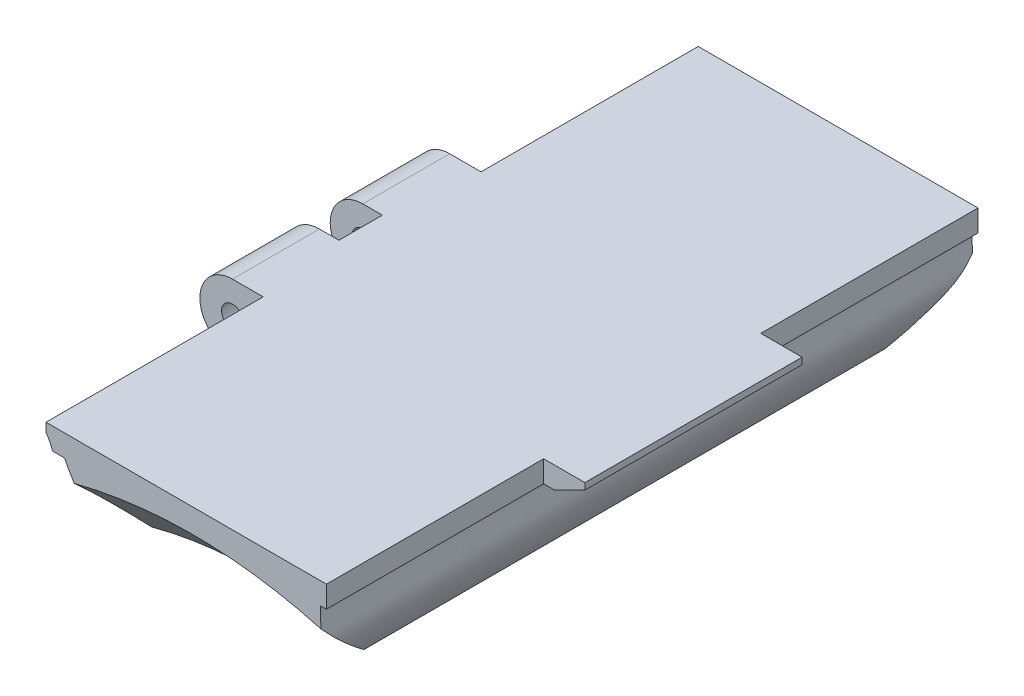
ISO-10303-21;
HEADER;
FILE_DESCRIPTION(('STEP AP214'),'2;1');
FILE_NAME('part.step','',(''),(''),'','','');
FILE_SCHEMA(('AUTOMOTIVE_DESIGN { 1 0 10303 214 1 1 1 1 }'));
ENDSEC;
DATA;
#1=APPLICATION_CONTEXT('core data for automotive mechanical design processes');
#2=APPLICATION_PROTOCOL_DEFINITION('international standard','automotive_design',2000,#1);
#3=PRODUCT_CONTEXT('',#1,'mechanical');
#4=PRODUCT('Part','Part','',(#3));
#5=PRODUCT_RELATED_PRODUCT_CATEGORY('part','',(#4));
#6=PRODUCT_DEFINITION_FORMATION('','',#4);
#7=PRODUCT_DEFINITION_CONTEXT('part definition',#1,'design');
#8=PRODUCT_DEFINITION('design','',#6,#7);
#9=PRODUCT_DEFINITION_SHAPE('','',#8);
#10=(LENGTH_UNIT() NAMED_UNIT(*) SI_UNIT(.MILLI.,.METRE.));
#11=(NAMED_UNIT(*) PLANE_ANGLE_UNIT() SI_UNIT($,.RADIAN.));
#12=(NAMED_UNIT(*) SI_UNIT($,.STERADIAN.) SOLID_ANGLE_UNIT());
#13=UNCERTAINTY_MEASURE_WITH_UNIT(LENGTH_MEASURE(1.E-05),#10,'distance_accuracy_value','');
#14=(GEOMETRIC_REPRESENTATION_CONTEXT(3) GLOBAL_UNCERTAINTY_ASSIGNED_CONTEXT((#13)) GLOBAL_UNIT_ASSIGNED_CONTEXT((#10,
#11,#12)) REPRESENTATION_CONTEXT('',''));
#15=CARTESIAN_POINT('',(0.,0.,0.));
#16=DIRECTION('',(0.,0.,1.));
#17=DIRECTION('',(1.,0.,0.));
#18=AXIS2_PLACEMENT_3D('',#15,#16,#17);
#19=CARTESIAN_POINT('',(-40.8141571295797,107.5,-95.));
#20=DIRECTION('',(0.,0.,-1.));
#21=DIRECTION('',(-1.,0.,0.));
#22=AXIS2_PLACEMENT_3D('',#19,#20,#21);
#23=CYLINDRICAL_SURFACE('',#22,7.50000000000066);
#24=DIRECTION('',(0.,0.,1.));
#25=VECTOR('',#24,1.);
#26=CARTESIAN_POINT('',(-40.8141571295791,115.,-45.));
#27=LINE('',#26,#25);
#28=CARTESIAN_POINT('',(-40.8141571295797,115.,-115.));
#29=VERTEX_POINT('',#28);
#30=CARTESIAN_POINT('',(-40.8141571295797,115.,-95.));
#31=VERTEX_POINT('',#30);
#32=EDGE_CURVE('E280',#29,#31,#27,.T.);
#33=ORIENTED_EDGE('',*,*,#32,.F.);
#34=CARTESIAN_POINT('',(-40.8141571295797,107.5,-115.));
#35=DIRECTION('',(0.,0.,-1.));
#36=DIRECTION('',(-1.,0.,0.));
#37=AXIS2_PLACEMENT_3D('',#34,#35,#36);
#38=CIRCLE('',#37,7.50000000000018);
#39=CARTESIAN_POINT('',(-36.3141571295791,101.5,-115.));
#40=VERTEX_POINT('',#39);
#41=EDGE_CURVE('E265',#40,#29,#38,.T.);
#42=ORIENTED_EDGE('',*,*,#41,.F.);
#43=DIRECTION('',(0.,0.,-1.));
#44=VECTOR('',#43,1.);
#45=CARTESIAN_POINT('',(-36.3141571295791,101.5,-115.));
#46=LINE('',#45,#44);
#47=CARTESIAN_POINT('',(-36.3141571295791,101.5,-125.));
#48=VERTEX_POINT('',#47);
#49=EDGE_CURVE('E577',#40,#48,#46,.T.);
#50=ORIENTED_EDGE('',*,*,#49,.T.);
#51=CARTESIAN_POINT('',(-40.8141571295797,107.5,-125.));
#52=DIRECTION('',(0.,0.,-1.));
#53=DIRECTION('',(-1.,0.,0.));
#54=AXIS2_PLACEMENT_3D('',#51,#52,#53);
#55=CIRCLE('',#54,7.50000000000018);
#56=CARTESIAN_POINT('',(-40.8141571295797,115.,-125.));
#57=VERTEX_POINT('',#56);
#58=EDGE_CURVE('E602',#48,#57,#55,.T.);
#59=ORIENTED_EDGE('',*,*,#58,.T.);
#60=CARTESIAN_POINT('',(-40.8141571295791,115.,-145.));
#61=VERTEX_POINT('',#60);
#62=EDGE_CURVE('E290',#61,#57,#27,.T.);
#63=ORIENTED_EDGE('',*,*,#62,.F.);
#64=CARTESIAN_POINT('',(-40.8141571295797,107.5,-145.));
#65=DIRECTION('',(0.,0.,-1.));
#66=DIRECTION('',(-1.,0.,0.));
#67=AXIS2_PLACEMENT_3D('',#64,#65,#66);
#68=CIRCLE('',#67,7.50000000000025);
#69=CARTESIAN_POINT('',(-33.7430893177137,110.,-145.));
#70=VERTEX_POINT('',#69);
#71=EDGE_CURVE('E101',#70,#61,#68,.T.);
#72=ORIENTED_EDGE('',*,*,#71,.F.);
#73=DIRECTION('',(0.,0.,-1.));
#74=VECTOR('',#73,1.);
#75=CARTESIAN_POINT('',(-33.7430893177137,110.,-45.));
#76=LINE('',#75,#74);
#77=CARTESIAN_POINT('',(-33.7430893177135,110.,-95.));
#78=VERTEX_POINT('',#77);
#79=EDGE_CURVE('E507',#78,#70,#76,.T.);
#80=ORIENTED_EDGE('',*,*,#79,.F.);
#81=CARTESIAN_POINT('',(-40.8141571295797,107.5,-95.));
#82=DIRECTION('',(0.,0.,1.));
#83=DIRECTION('',(1.,0.,0.));
#84=AXIS2_PLACEMENT_3D('',#81,#82,#83);
#85=CIRCLE('',#84,7.50000000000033);
#86=EDGE_CURVE('E288',#31,#78,#85,.T.);
#87=ORIENTED_EDGE('',*,*,#86,.F.);
#88=EDGE_LOOP('',(#33,#42,#50,#59,#63,#72,#80,#87));
#89=FACE_BOUND('',#88,.T.);
#90=ADVANCED_FACE('F67',(#89),#23,.T.);
#91=CARTESIAN_POINT('',(1.49519052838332,115.,-45.));
#92=DIRECTION('',(0.,1.,0.));
#93=DIRECTION('',(1.,0.,0.));
#94=AXIS2_PLACEMENT_3D('',#91,#92,#93);
#95=PLANE('',#94);
#96=DIRECTION('',(0.,0.,-1.));
#97=VECTOR('',#96,1.);
#98=CARTESIAN_POINT('',(-36.3141571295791,115.,-115.));
#99=LINE('',#98,#97);
#100=CARTESIAN_POINT('',(-36.3141571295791,115.,-115.));
#101=VERTEX_POINT('',#100);
#102=CARTESIAN_POINT('',(-36.3141571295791,115.,-125.));
#103=VERTEX_POINT('',#102);
#104=EDGE_CURVE('E283',#101,#103,#99,.T.);
#105=ORIENTED_EDGE('',*,*,#104,.F.);
#106=DIRECTION('',(1.,0.,0.));
#107=VECTOR('',#106,1.);
#108=CARTESIAN_POINT('',(-40.8141571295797,115.,-115.));
#109=LINE('',#108,#107);
#110=EDGE_CURVE('E268',#29,#101,#109,.T.);
#111=ORIENTED_EDGE('',*,*,#110,.F.);
#112=ORIENTED_EDGE('',*,*,#32,.T.);
#113=DIRECTION('',(-1.,1.99394871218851E-13,0.));
#114=VECTOR('',#113,1.);
#115=CARTESIAN_POINT('',(-35.9702740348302,115.,-95.));
#116=LINE('',#115,#114);
#117=CARTESIAN_POINT('',(-33.7430893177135,115.,-95.));
#118=VERTEX_POINT('',#117);
#119=EDGE_CURVE('E538',#118,#31,#116,.T.);
#120=ORIENTED_EDGE('',*,*,#119,.F.);
#121=DIRECTION('',(0.,0.,1.));
#122=VECTOR('',#121,1.);
#123=CARTESIAN_POINT('',(-33.7430893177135,115.,-95.));
#124=LINE('',#123,#122);
#125=CARTESIAN_POINT('',(-33.7430893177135,115.,-45.));
#126=VERTEX_POINT('',#125);
#127=EDGE_CURVE('E314',#118,#126,#124,.T.);
#128=ORIENTED_EDGE('',*,*,#127,.T.);
#129=DIRECTION('',(1.,0.,0.));
#130=VECTOR('',#129,1.);
#131=CARTESIAN_POINT('',(1.49519052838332,115.,-45.));
#132=LINE('',#131,#130);
#133=CARTESIAN_POINT('',(30.8141571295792,115.,-45.));
#134=VERTEX_POINT('',#133);
#135=EDGE_CURVE('E297',#126,#134,#132,.T.);
#136=ORIENTED_EDGE('',*,*,#135,.T.);
#137=DIRECTION('',(0.,0.,-1.));
#138=VECTOR('',#137,1.);
#139=CARTESIAN_POINT('',(30.8141571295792,115.,-45.));
#140=LINE('',#139,#138);
#141=CARTESIAN_POINT('',(30.8141571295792,115.,-95.));
#142=VERTEX_POINT('',#141);
#143=EDGE_CURVE('E801',#134,#142,#140,.T.);
#144=ORIENTED_EDGE('',*,*,#143,.T.);
#145=DIRECTION('',(1.,0.,0.));
#146=VECTOR('',#145,1.);
#147=CARTESIAN_POINT('',(37.0641571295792,115.,-95.));
#148=LINE('',#147,#146);
#149=CARTESIAN_POINT('',(40.3141571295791,115.,-95.));
#150=VERTEX_POINT('',#149);
#151=EDGE_CURVE('E308',#142,#150,#148,.T.);
#152=ORIENTED_EDGE('',*,*,#151,.T.);
#153=DIRECTION('',(0.,0.,-1.));
#154=VECTOR('',#153,1.);
#155=CARTESIAN_POINT('',(40.3141571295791,115.,-120.));
#156=LINE('',#155,#154);
#157=CARTESIAN_POINT('',(40.3141571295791,115.,-145.));
#158=VERTEX_POINT('',#157);
#159=EDGE_CURVE('E313',#150,#158,#156,.T.);
#160=ORIENTED_EDGE('',*,*,#159,.T.);
#161=DIRECTION('',(1.,0.,0.));
#162=VECTOR('',#161,1.);
#163=CARTESIAN_POINT('',(37.0641571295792,115.,-145.));
#164=LINE('',#163,#162);
#165=CARTESIAN_POINT('',(30.8141571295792,115.,-145.));
#166=VERTEX_POINT('',#165);
#167=EDGE_CURVE('E315',#166,#158,#164,.T.);
#168=ORIENTED_EDGE('',*,*,#167,.F.);
#169=DIRECTION('',(0.,0.,-1.));
#170=VECTOR('',#169,1.);
#171=CARTESIAN_POINT('',(30.8141571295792,115.,-45.));
#172=LINE('',#171,#170);
#173=CARTESIAN_POINT('',(30.8141571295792,115.,-195.));
#174=VERTEX_POINT('',#173);
#175=EDGE_CURVE('E298',#166,#174,#172,.T.);
#176=ORIENTED_EDGE('',*,*,#175,.T.);
#177=DIRECTION('',(1.,0.,0.));
#178=VECTOR('',#177,1.);
#179=CARTESIAN_POINT('',(1.49519052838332,115.,-195.));
#180=LINE('',#179,#178);
#181=CARTESIAN_POINT('',(-33.5924875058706,115.,-195.));
#182=VERTEX_POINT('',#181);
#183=EDGE_CURVE('E291',#182,#174,#180,.T.);
#184=ORIENTED_EDGE('',*,*,#183,.F.);
#185=DIRECTION('',(0.,0.,-1.));
#186=VECTOR('',#185,1.);
#187=CARTESIAN_POINT('',(-33.5924875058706,115.,-145.));
#188=LINE('',#187,#186);
#189=CARTESIAN_POINT('',(-33.5924875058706,115.,-145.));
#190=VERTEX_POINT('',#189);
#191=EDGE_CURVE('E564',#190,#182,#188,.T.);
#192=ORIENTED_EDGE('',*,*,#191,.F.);
#193=DIRECTION('',(1.,0.,0.));
#194=VECTOR('',#193,1.);
#195=CARTESIAN_POINT('',(-33.5924875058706,115.,-145.));
#196=LINE('',#195,#194);
#197=EDGE_CURVE('E572',#61,#190,#196,.T.);
#198=ORIENTED_EDGE('',*,*,#197,.F.);
#199=ORIENTED_EDGE('',*,*,#62,.T.);
#200=DIRECTION('',(1.,0.,0.));
#201=VECTOR('',#200,1.);
#202=CARTESIAN_POINT('',(-40.8141571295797,115.,-125.));
#203=LINE('',#202,#201);
#204=EDGE_CURVE('E599',#57,#103,#203,.T.);
#205=ORIENTED_EDGE('',*,*,#204,.T.);
#206=EDGE_LOOP('',(#105,#111,#112,#120,#128,#136,#144,#152,#160,#168,#176,#184,#192,#198,#199,#205));
#207=FACE_BOUND('',#206,.T.);
#208=ADVANCED_FACE('F278',(#207),#95,.T.);
#209=CARTESIAN_POINT('',(40.3141571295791,90.,-120.));
#210=DIRECTION('',(1.,0.,0.));
#211=DIRECTION('',(0.,1.,0.));
#212=AXIS2_PLACEMENT_3D('',#209,#210,#211);
#213=PLANE('',#212);
#214=DIRECTION('',(0.,1.,0.));
#215=VECTOR('',#214,1.);
#216=CARTESIAN_POINT('',(40.3141571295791,90.,-145.));
#217=LINE('',#216,#215);
#218=CARTESIAN_POINT('',(40.3141571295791,113.5,-145.));
#219=VERTEX_POINT('',#218);
#220=EDGE_CURVE('E448',#219,#158,#217,.T.);
#221=ORIENTED_EDGE('',*,*,#220,.T.);
#222=ORIENTED_EDGE('',*,*,#159,.F.);
#223=DIRECTION('',(0.,1.,0.));
#224=VECTOR('',#223,1.);
#225=CARTESIAN_POINT('',(40.3141571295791,90.,-95.));
#226=LINE('',#225,#224);
#227=CARTESIAN_POINT('',(40.3141571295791,113.5,-95.));
#228=VERTEX_POINT('',#227);
#229=EDGE_CURVE('E443',#228,#150,#226,.T.);
#230=ORIENTED_EDGE('',*,*,#229,.F.);
#231=DIRECTION('',(0.,0.,1.));
#232=VECTOR('',#231,1.);
#233=CARTESIAN_POINT('',(40.3141571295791,113.5,-95.));
#234=LINE('',#233,#232);
#235=EDGE_CURVE('E747',#219,#228,#234,.T.);
#236=ORIENTED_EDGE('',*,*,#235,.F.);
#237=EDGE_LOOP('',(#221,#222,#230,#236));
#238=FACE_BOUND('',#237,.T.);
#239=ADVANCED_FACE('F370',(#238),#213,.T.);
#240=CARTESIAN_POINT('',(0.,0.,-195.));
#241=DIRECTION('',(0.,0.,-1.));
#242=DIRECTION('',(-1.,0.,0.));
#243=AXIS2_PLACEMENT_3D('',#240,#241,#242);
#244=CONICAL_SURFACE('',#243,109.5,0.785398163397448);
#245=CARTESIAN_POINT('',(24.4583997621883,91.2799905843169,-180.));
#246=CARTESIAN_POINT('',(24.5987242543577,91.4954660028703,-180.24445255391));
#247=CARTESIAN_POINT('',(24.7373274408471,91.7116619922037,-180.489255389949));
#248=CARTESIAN_POINT('',(25.0112410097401,92.1454601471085,-180.979538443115));
#249=CARTESIAN_POINT('',(25.1465508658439,92.3630625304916,-181.22501876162));
#250=CARTESIAN_POINT('',(25.4139973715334,92.7995933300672,-181.71658215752));
#251=CARTESIAN_POINT('',(25.5461336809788,93.0185218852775,-181.962665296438));
#252=CARTESIAN_POINT('',(25.8072430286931,93.4576720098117,-182.455379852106));
#253=CARTESIAN_POINT('',(25.9362159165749,93.6778936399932,-182.702011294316));
#254=CARTESIAN_POINT('',(26.1924451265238,94.1222206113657,-183.198681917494));
#255=CARTESIAN_POINT('',(26.3196634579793,94.3463411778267,-183.448727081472));
#256=CARTESIAN_POINT('',(26.5706891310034,94.7959259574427,-183.949304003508));
#257=CARTESIAN_POINT('',(26.6944965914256,95.0213901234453,-184.199835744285));
#258=CARTESIAN_POINT('',(26.9385076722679,95.4737155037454,-184.701362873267));
#259=CARTESIAN_POINT('',(27.058711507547,95.7005766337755,-184.952358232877));
#260=CARTESIAN_POINT('',(27.2952412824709,96.1557831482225,-185.45480054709));
#261=CARTESIAN_POINT('',(27.4115674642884,96.3841284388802,-185.706247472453));
#262=CARTESIAN_POINT('',(27.6097890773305,96.781865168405,-186.143075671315));
#263=CARTESIAN_POINT('',(27.6926582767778,96.9508863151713,-186.328352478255));
#264=CARTESIAN_POINT('',(27.8559110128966,97.2898629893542,-186.699151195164));
#265=CARTESIAN_POINT('',(27.9362945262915,97.4598185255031,-186.884673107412));
#266=CARTESIAN_POINT('',(28.0943485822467,97.800742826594,-187.255967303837));
#267=CARTESIAN_POINT('',(28.1720189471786,97.9717116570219,-187.441739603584));
#268=CARTESIAN_POINT('',(28.3243630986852,98.3147628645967,-187.813544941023));
#269=CARTESIAN_POINT('',(28.3990364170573,98.4868454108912,-187.999578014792));
#270=CARTESIAN_POINT('',(28.5445713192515,98.8311451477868,-188.370731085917));
#271=CARTESIAN_POINT('',(28.6154533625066,99.0033551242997,-188.555849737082));
#272=CARTESIAN_POINT('',(28.7533945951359,99.349082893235,-188.926290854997));
#273=CARTESIAN_POINT('',(28.8204538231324,99.5226006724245,-189.111613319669));
#274=CARTESIAN_POINT('',(28.9500555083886,99.871110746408,-189.482422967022));
#275=CARTESIAN_POINT('',(29.0125983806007,100.046102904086,-189.667910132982));
#276=CARTESIAN_POINT('',(29.1322261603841,100.397814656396,-190.039024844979));
#277=CARTESIAN_POINT('',(29.1893110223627,100.574534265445,-190.224652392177));
#278=CARTESIAN_POINT('',(29.2800999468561,100.875356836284,-190.538858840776));
#279=CARTESIAN_POINT('',(29.3155955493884,100.998927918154,-190.667426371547));
#280=CARTESIAN_POINT('',(29.3826207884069,101.247177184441,-190.92451941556));
#281=CARTESIAN_POINT('',(29.4141504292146,101.371855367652,-191.053044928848));
#282=CARTESIAN_POINT('',(29.5020380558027,101.747602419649,-191.438400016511));
#283=CARTESIAN_POINT('',(29.5517195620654,102.00046359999,-191.695091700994));
#284=CARTESIAN_POINT('',(29.6098671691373,102.383333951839,-192.079036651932));
#285=CARTESIAN_POINT('',(29.6265216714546,102.511570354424,-192.206852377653));
#286=CARTESIAN_POINT('',(29.6539632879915,102.769179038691,-192.461961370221));
#287=CARTESIAN_POINT('',(29.664750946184,102.898551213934,-192.589254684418));
#288=CARTESIAN_POINT('',(29.6776854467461,103.116103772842,-192.801889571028));
#289=CARTESIAN_POINT('',(29.6815011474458,103.204005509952,-192.887419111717));
#290=CARTESIAN_POINT('',(29.6864994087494,103.380208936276,-193.058148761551));
#291=CARTESIAN_POINT('',(29.6876818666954,103.468510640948,-193.143348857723));
#292=CARTESIAN_POINT('',(29.6876685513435,103.645430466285,-193.313414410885));
#293=CARTESIAN_POINT('',(29.686472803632,103.734048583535,-193.398279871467));
#294=CARTESIAN_POINT('',(29.6820430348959,103.911653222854,-193.567824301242));
#295=CARTESIAN_POINT('',(29.6788060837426,104.000640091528,-193.652502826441));
#296=CARTESIAN_POINT('',(29.6706935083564,104.178785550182,-193.821598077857));
#297=CARTESIAN_POINT('',(29.6658178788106,104.267944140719,-193.906014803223));
#298=CARTESIAN_POINT('',(29.654853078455,104.446379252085,-194.074654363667));
#299=CARTESIAN_POINT('',(29.6487638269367,104.535655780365,-194.158877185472));
#300=CARTESIAN_POINT('',(29.6357867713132,104.714323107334,-194.32724100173));
#301=CARTESIAN_POINT('',(29.6288985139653,104.803713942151,-194.411381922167));
#302=CARTESIAN_POINT('',(29.6147019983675,104.982513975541,-194.579594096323));
#303=CARTESIAN_POINT('',(29.6073937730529,105.071923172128,-194.663665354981));
#304=CARTESIAN_POINT('',(29.5926453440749,105.250720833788,-194.831779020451));
#305=CARTESIAN_POINT('',(29.5852051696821,105.34010929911,-194.91582142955));
#306=CARTESIAN_POINT('',(29.577841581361,105.429483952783,-194.99988492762));
#307=B_SPLINE_CURVE_WITH_KNOTS('',3,(#245,#246,#247,#248,#249,#250,#251,#252,#253,#254,#255,
#256,#257,#258,#259,#260,#261,#262,#263,#264,#265,#266,#267,#268,#269,#270,#271,#272,#273,#274,
#275,#276,#277,#278,#279,#280,#281,#282,#283,#284,#285,#286,#287,#288,#289,#290,#291,#292,#293,
#294,#295,#296,#297,#298,#299,#300,#301,#302,#303,#304,#305,#306),.UNSPECIFIED.,.F.,.F.,(4,2,2,
2,2,2,2,2,2,2,2,2,2,2,2,2,2,2,2,2,2,2,2,2,2,2,2,2,2,2,4),(0.,1.06436950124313,2.12890799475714,
3.19356008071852,4.25826268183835,5.33547882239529,6.41265737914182,7.48977158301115,
8.56681839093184,9.35918687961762,10.1515627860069,10.9439904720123,11.7365414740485,
12.524261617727,13.3119738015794,14.0996135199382,14.8872598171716,15.4326830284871,
15.9781056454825,17.0685966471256,17.6139807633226,18.1593143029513,18.5274011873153,
18.895502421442,19.2635996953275,19.6322265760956,20.0008546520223,20.3695072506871,
20.7383700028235,21.1072038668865,21.4759569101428),.UNSPECIFIED.);
#308=CARTESIAN_POINT('',(24.4583997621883,91.2799905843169,-180.));
#309=VERTEX_POINT('',#308);
#310=CARTESIAN_POINT('',(29.578468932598,105.429427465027,-195.));
#311=VERTEX_POINT('',#310);
#312=EDGE_CURVE('E354',#309,#311,#307,.T.);
#313=ORIENTED_EDGE('',*,*,#312,.F.);
#314=CARTESIAN_POINT('',(0.,0.,-180.));
#315=DIRECTION('',(0.,0.,-1.));
#316=DIRECTION('',(1.,0.,0.));
#317=AXIS2_PLACEMENT_3D('',#314,#315,#316);
#318=CIRCLE('',#317,94.5);
#319=CARTESIAN_POINT('',(-24.4583997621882,91.279990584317,-180.));
#320=VERTEX_POINT('',#319);
#321=EDGE_CURVE('E480',#320,#309,#318,.T.);
#322=ORIENTED_EDGE('',*,*,#321,.F.);
#323=CARTESIAN_POINT('',(-27.2318477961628,106.059681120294,-194.999906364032));
#324=CARTESIAN_POINT('',(-27.1799094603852,105.97888651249,-194.908733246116));
#325=CARTESIAN_POINT('',(-27.1278930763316,105.898119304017,-194.817580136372));
#326=CARTESIAN_POINT('',(-27.0240097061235,105.736501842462,-194.635255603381));
#327=CARTESIAN_POINT('',(-26.9721427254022,105.655651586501,-194.544084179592));
#328=CARTESIAN_POINT('',(-26.86902321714,105.493980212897,-194.361946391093));
#329=CARTESIAN_POINT('',(-26.8177693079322,105.41315974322,-194.270980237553));
#330=CARTESIAN_POINT('',(-26.7161233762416,105.25113415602,-194.088911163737));
#331=CARTESIAN_POINT('',(-26.6657313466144,105.169929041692,-193.997808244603));
#332=CARTESIAN_POINT('',(-26.5168667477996,104.926029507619,-193.724825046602));
#333=CARTESIAN_POINT('',(-26.4203364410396,104.762484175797,-193.542629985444));
#334=CARTESIAN_POINT('',(-26.236190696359,104.432401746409,-193.177582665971));
#335=CARTESIAN_POINT('',(-26.1485479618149,104.265875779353,-192.994734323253));
#336=CARTESIAN_POINT('',(-26.0252625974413,104.013252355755,-192.719730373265));
#337=CARTESIAN_POINT('',(-25.9855604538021,103.928644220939,-192.628017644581));
#338=CARTESIAN_POINT('',(-25.9088475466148,103.758487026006,-192.444339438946));
#339=CARTESIAN_POINT('',(-25.8718368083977,103.672937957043,-192.352373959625));
#340=CARTESIAN_POINT('',(-25.7647180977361,103.415014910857,-192.076194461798));
#341=CARTESIAN_POINT('',(-25.6985116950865,103.241340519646,-191.891670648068));
#342=CARTESIAN_POINT('',(-25.5760070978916,102.892653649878,-191.523723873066));
#343=CARTESIAN_POINT('',(-25.5196308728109,102.717664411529,-191.340304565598));
#344=CARTESIAN_POINT('',(-25.4149177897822,102.365363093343,-190.97315079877));
#345=CARTESIAN_POINT('',(-25.3665868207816,102.188049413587,-190.789416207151));
#346=CARTESIAN_POINT('',(-25.276622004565,101.831558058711,-190.421751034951));
#347=CARTESIAN_POINT('',(-25.2349952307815,101.65237862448,-190.237820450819));
#348=CARTESIAN_POINT('',(-25.1569928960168,101.292628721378,-189.869875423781));
#349=CARTESIAN_POINT('',(-25.1206222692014,101.112057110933,-189.685861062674));
#350=CARTESIAN_POINT('',(-25.0522481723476,100.749862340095,-189.317868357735));
#351=CARTESIAN_POINT('',(-25.0202470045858,100.568238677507,-189.133890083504));
#352=CARTESIAN_POINT('',(-24.9599594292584,100.20422777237,-188.766096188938));
#353=CARTESIAN_POINT('',(-24.9316729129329,100.021840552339,-188.582280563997));
#354=CARTESIAN_POINT('',(-24.8642257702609,99.5599828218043,-188.117830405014));
#355=CARTESIAN_POINT('',(-24.8272069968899,99.280086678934,-187.837307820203));
#356=CARTESIAN_POINT('',(-24.7595193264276,98.7193218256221,-187.276898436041));
#357=CARTESIAN_POINT('',(-24.7288457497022,98.4384539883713,-186.997011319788));
#358=CARTESIAN_POINT('',(-24.6730112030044,97.8758659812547,-186.437807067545));
#359=CARTESIAN_POINT('',(-24.6478477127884,97.5941462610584,-186.158489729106));
#360=CARTESIAN_POINT('',(-24.6024199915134,97.0299411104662,-185.600381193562));
#361=CARTESIAN_POINT('',(-24.5821544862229,96.7474558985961,-185.321589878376));
#362=CARTESIAN_POINT('',(-24.5460705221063,96.1817785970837,-184.764502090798));
#363=CARTESIAN_POINT('',(-24.5302515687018,95.8985865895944,-184.486205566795));
#364=CARTESIAN_POINT('',(-24.5025550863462,95.3277183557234,-183.926346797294));
#365=CARTESIAN_POINT('',(-24.4907334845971,95.0400330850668,-183.644791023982));
#366=CARTESIAN_POINT('',(-24.4711138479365,94.4639939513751,-183.082158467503));
#367=CARTESIAN_POINT('',(-24.4633162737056,94.1756400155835,-182.80108174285));
#368=CARTESIAN_POINT('',(-24.451640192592,93.5982790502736,-182.23942342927));
#369=CARTESIAN_POINT('',(-24.4477623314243,93.309271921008,-181.958841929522));
#370=CARTESIAN_POINT('',(-24.4439169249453,92.7306060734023,-181.398202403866));
#371=CARTESIAN_POINT('',(-24.4439502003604,92.4409472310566,-181.118144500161));
#372=CARTESIAN_POINT('',(-24.4480842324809,91.8609564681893,-180.558604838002));
#373=CARTESIAN_POINT('',(-24.4521860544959,91.5706243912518,-180.279123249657));
#374=CARTESIAN_POINT('',(-24.4583997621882,91.279990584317,-180.));
#375=B_SPLINE_CURVE_WITH_KNOTS('',3,(#323,#324,#325,#326,#327,#328,#329,#330,#331,#332,#333,
#334,#335,#336,#337,#338,#339,#340,#341,#342,#343,#344,#345,#346,#347,#348,#349,#350,#351,#352,
#353,#354,#355,#356,#357,#358,#359,#360,#361,#362,#363,#364,#365,#366,#367,#368,#369,#370,#371,
#372,#373,#374),.UNSPECIFIED.,.F.,.F.,(4,2,2,2,2,2,2,2,2,2,2,2,2,2,2,2,2,2,2,2,2,2,2,2,2,4),(0.,
0.397292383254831,0.794599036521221,1.1907070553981,1.58681178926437,2.3762274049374,
3.16313995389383,3.55593844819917,3.9487406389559,4.73423044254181,5.51316916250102,
6.29267556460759,7.07299909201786,7.85405044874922,8.63551176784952,9.41695020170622,
10.610887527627,11.8039411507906,12.9964479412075,14.1886441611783,15.3807077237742,
16.5888191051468,17.7970687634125,19.0055174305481,20.2142196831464,21.4232385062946),.UNSPECIFIED.);
#376=CARTESIAN_POINT('',(-27.2313239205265,106.059912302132,-195.));
#377=VERTEX_POINT('',#376);
#378=EDGE_CURVE('E479',#377,#320,#375,.T.);
#379=ORIENTED_EDGE('',*,*,#378,.F.);
#380=CARTESIAN_POINT('',(0.,0.,-195.));
#381=DIRECTION('',(0.,0.,1.));
#382=DIRECTION('',(1.,0.,0.));
#383=AXIS2_PLACEMENT_3D('',#380,#381,#382);
#384=CIRCLE('',#383,109.5);
#385=EDGE_CURVE('E12',#311,#377,#384,.T.);
#386=ORIENTED_EDGE('',*,*,#385,.F.);
#387=EDGE_LOOP('',(#313,#322,#379,#386));
#388=FACE_BOUND('',#387,.T.);
#389=ADVANCED_FACE('F359',(#388),#244,.F.);
#390=CARTESIAN_POINT('',(0.,0.,-60.));
#391=DIRECTION('',(0.,0.,1.));
#392=DIRECTION('',(1.,0.,0.));
#393=AXIS2_PLACEMENT_3D('',#390,#391,#392);
#394=CONICAL_SURFACE('',#393,94.5,0.785398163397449);
#395=CARTESIAN_POINT('',(29.577841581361,105.429483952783,-45.0001150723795));
#396=CARTESIAN_POINT('',(29.5852003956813,105.340167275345,-45.0841240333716));
#397=CARTESIAN_POINT('',(29.5926356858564,105.250836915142,-45.1681118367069));
#398=CARTESIAN_POINT('',(29.6073733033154,105.072172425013,-45.3361002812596));
#399=CARTESIAN_POINT('',(29.6146756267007,104.982838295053,-45.4201009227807));
#400=CARTESIAN_POINT('',(29.6288396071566,104.8044636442,-45.5879126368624));
#401=CARTESIAN_POINT('',(29.6357025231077,104.715423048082,-45.6717235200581));
#402=CARTESIAN_POINT('',(29.6486409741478,104.537406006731,-45.8394725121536));
#403=CARTESIAN_POINT('',(29.6547165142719,104.448429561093,-45.9234106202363));
#404=CARTESIAN_POINT('',(29.6711014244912,104.182298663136,-46.1749236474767));
#405=CARTESIAN_POINT('',(29.6796255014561,104.005303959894,-46.342796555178));
#406=CARTESIAN_POINT('',(29.6885765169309,103.652845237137,-46.679217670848));
#407=CARTESIAN_POINT('',(29.6890309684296,103.477378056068,-46.8477616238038));
#408=CARTESIAN_POINT('',(29.6819307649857,103.215530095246,-47.1013864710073));
#409=CARTESIAN_POINT('',(29.6782748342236,103.128562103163,-47.1859750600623));
#410=CARTESIAN_POINT('',(29.6682411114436,102.955081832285,-47.3554572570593));
#411=CARTESIAN_POINT('',(29.6618633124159,102.868569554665,-47.4403508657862));
#412=CARTESIAN_POINT('',(29.6387285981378,102.609833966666,-47.6953598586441));
#413=CARTESIAN_POINT('',(29.6179685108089,102.438343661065,-47.8658695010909));
#414=CARTESIAN_POINT('',(29.5669436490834,102.099170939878,-48.2058592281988));
#415=CARTESIAN_POINT('',(29.5367736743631,101.931467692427,-48.3753331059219));
#416=CARTESIAN_POINT('',(29.4680091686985,101.598051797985,-48.7147103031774));
#417=CARTESIAN_POINT('',(29.4294097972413,101.432340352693,-48.8846138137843));
#418=CARTESIAN_POINT('',(29.3448751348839,101.10274817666,-49.2247067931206));
#419=CARTESIAN_POINT('',(29.2989322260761,100.938869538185,-49.3948963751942));
#420=CARTESIAN_POINT('',(29.2011180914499,100.612684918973,-49.735417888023));
#421=CARTESIAN_POINT('',(29.1492407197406,100.450380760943,-49.9057497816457));
#422=CARTESIAN_POINT('',(29.0407314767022,100.127147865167,-50.2464160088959));
#423=CARTESIAN_POINT('',(28.9840965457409,99.9662200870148,-50.4167502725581));
#424=CARTESIAN_POINT('',(28.8668705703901,99.6456555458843,-50.7572761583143));
#425=CARTESIAN_POINT('',(28.8062794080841,99.4860188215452,-50.9274677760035));
#426=CARTESIAN_POINT('',(28.6532549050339,99.0951513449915,-51.3454677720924));
#427=CARTESIAN_POINT('',(28.5589301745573,98.8645612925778,-51.5931825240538));
#428=CARTESIAN_POINT('',(28.3644454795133,98.4056253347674,-52.088047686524));
#429=CARTESIAN_POINT('',(28.2642895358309,98.1772780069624,-52.3351983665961));
#430=CARTESIAN_POINT('',(28.0589146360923,97.7225321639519,-52.8289879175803));
#431=CARTESIAN_POINT('',(27.9536976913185,97.4961329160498,-53.0756269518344));
#432=CARTESIAN_POINT('',(27.738792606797,97.0450619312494,-53.5684243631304));
#433=CARTESIAN_POINT('',(27.6291054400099,96.8203898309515,-53.8145828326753));
#434=CARTESIAN_POINT('',(27.40570046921,96.3726085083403,-54.3064375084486));
#435=CARTESIAN_POINT('',(27.2919830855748,96.149499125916,-54.5521337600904));
#436=CARTESIAN_POINT('',(27.0608561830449,95.704717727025,-55.0430727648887));
#437=CARTESIAN_POINT('',(26.9434467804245,95.4830456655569,-55.2883155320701));
#438=CARTESIAN_POINT('',(26.7028935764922,95.0367890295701,-55.7830679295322));
#439=CARTESIAN_POINT('',(26.5796828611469,94.8122306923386,-56.0325686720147));
#440=CARTESIAN_POINT('',(26.3298744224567,94.3644464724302,-56.5310893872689));
#441=CARTESIAN_POINT('',(26.2032765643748,94.1412206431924,-56.7801093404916));
#442=CARTESIAN_POINT('',(25.9468175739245,93.6960792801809,-57.2776336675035));
#443=CARTESIAN_POINT('',(25.8169564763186,93.4741637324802,-57.5261380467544));
#444=CARTESIAN_POINT('',(25.5540255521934,93.0316500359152,-58.0225854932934));
#445=CARTESIAN_POINT('',(25.4209559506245,92.811051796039,-58.2705285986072));
#446=CARTESIAN_POINT('',(25.1515990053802,92.3712057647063,-58.7657981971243));
#447=CARTESIAN_POINT('',(25.0153120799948,92.1519578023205,-59.0131247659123));
#448=CARTESIAN_POINT('',(24.7393984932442,91.7148932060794,-59.5070859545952));
#449=CARTESIAN_POINT('',(24.5997724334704,91.497076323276,-59.7537206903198));
#450=CARTESIAN_POINT('',(24.4583997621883,91.2799905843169,-60.));
#451=B_SPLINE_CURVE_WITH_KNOTS('',3,(#395,#396,#397,#398,#399,#400,#401,#402,#403,#404,#405,
#406,#407,#408,#409,#410,#411,#412,#413,#414,#415,#416,#417,#418,#419,#420,#421,#422,#423,#424,
#425,#426,#427,#428,#429,#430,#431,#432,#433,#434,#435,#436,#437,#438,#439,#440,#441,#442,#443,
#444,#445,#446,#447,#448,#449,#450),.UNSPECIFIED.,.F.,.F.,(4,2,2,2,2,2,2,2,2,2,2,2,2,2,2,2,2,2,
2,2,2,2,2,2,2,2,2,4),(0.,0.368513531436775,0.737037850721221,1.10445418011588,1.47186815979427,
2.20406351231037,2.93376199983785,3.29785936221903,3.66195766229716,4.38986947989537,
5.11067273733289,5.83189100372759,6.55386234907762,7.2765882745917,7.99978260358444,
8.72299849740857,9.77691080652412,10.8301048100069,11.8828836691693,12.935434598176,
13.9878760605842,15.0402844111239,16.1129815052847,17.1857213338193,18.2584497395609,
19.3311031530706,20.4036178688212,21.475940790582),.UNSPECIFIED.);
#452=CARTESIAN_POINT('',(29.578468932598,105.429427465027,-45.));
#453=VERTEX_POINT('',#452);
#454=CARTESIAN_POINT('',(24.4583997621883,91.2799905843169,-60.));
#455=VERTEX_POINT('',#454);
#456=EDGE_CURVE('E356',#453,#455,#451,.T.);
#457=ORIENTED_EDGE('',*,*,#456,.F.);
#458=CARTESIAN_POINT('',(0.,0.,-45.));
#459=DIRECTION('',(0.,0.,-1.));
#460=DIRECTION('',(1.,0.,0.));
#461=AXIS2_PLACEMENT_3D('',#458,#459,#460);
#462=CIRCLE('',#461,109.5);
#463=CARTESIAN_POINT('',(-27.2313239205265,106.059912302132,-45.));
#464=VERTEX_POINT('',#463);
#465=EDGE_CURVE('E85',#464,#453,#462,.T.);
#466=ORIENTED_EDGE('',*,*,#465,.F.);
#467=CARTESIAN_POINT('',(-24.4583997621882,91.279990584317,-60.));
#468=CARTESIAN_POINT('',(-24.4529536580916,91.534358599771,-59.7557084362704));
#469=CARTESIAN_POINT('',(-24.4491346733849,91.788494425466,-59.5111407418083));
#470=CARTESIAN_POINT('',(-24.4446328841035,92.2961283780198,-59.0216734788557));
#471=CARTESIAN_POINT('',(-24.4439478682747,92.5496268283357,-58.7767742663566));
#472=CARTESIAN_POINT('',(-24.4455881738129,93.056036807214,-58.2866499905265));
#473=CARTESIAN_POINT('',(-24.4479118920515,93.3089485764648,-58.0414251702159));
#474=CARTESIAN_POINT('',(-24.4555480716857,93.8142216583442,-57.5506400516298));
#475=CARTESIAN_POINT('',(-24.4608594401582,94.0665831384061,-57.3050799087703));
#476=CARTESIAN_POINT('',(-24.4745088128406,94.5707833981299,-56.8136066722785));
#477=CARTESIAN_POINT('',(-24.4828462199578,94.8226222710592,-56.5676936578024));
#478=CARTESIAN_POINT('',(-24.502551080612,95.3232683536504,-56.0779611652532));
#479=CARTESIAN_POINT('',(-24.5138871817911,95.5720805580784,-55.8341455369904));
#480=CARTESIAN_POINT('',(-24.5397888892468,96.0692248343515,-55.3461055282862));
#481=CARTESIAN_POINT('',(-24.5543550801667,96.3175568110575,-55.1018810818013));
#482=CARTESIAN_POINT('',(-24.5869513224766,96.8137378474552,-54.6129840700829));
#483=CARTESIAN_POINT('',(-24.6049826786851,97.0615866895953,-54.3683113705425));
#484=CARTESIAN_POINT('',(-24.644825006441,97.5567854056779,-53.8784711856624));
#485=CARTESIAN_POINT('',(-24.6666382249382,97.8041348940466,-53.633303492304));
#486=CARTESIAN_POINT('',(-24.7144539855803,98.2983045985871,-53.1424174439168));
#487=CARTESIAN_POINT('',(-24.7404600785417,98.5451241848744,-52.8966987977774));
#488=CARTESIAN_POINT('',(-24.7933065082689,99.0042536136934,-52.4385013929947));
#489=CARTESIAN_POINT('',(-24.819548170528,99.2166742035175,-52.2260647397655));
#490=CARTESIAN_POINT('',(-24.8759797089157,99.6407863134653,-51.8009246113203));
#491=CARTESIAN_POINT('',(-24.9061701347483,99.8524777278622,-51.5882211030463));
#492=CARTESIAN_POINT('',(-24.9710897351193,100.274836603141,-51.1626989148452));
#493=CARTESIAN_POINT('',(-25.0058166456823,100.485504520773,-50.9498803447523));
#494=CARTESIAN_POINT('',(-25.0806675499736,100.905469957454,-50.5242646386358));
#495=CARTESIAN_POINT('',(-25.1207859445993,101.114768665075,-50.3114677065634));
#496=CARTESIAN_POINT('',(-25.185979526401,101.427423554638,-49.9923170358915));
#497=CARTESIAN_POINT('',(-25.2085299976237,101.53135738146,-49.8860118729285));
#498=CARTESIAN_POINT('',(-25.2555327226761,101.738774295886,-49.673380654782));
#499=CARTESIAN_POINT('',(-25.2799849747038,101.842257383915,-49.5670545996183));
#500=CARTESIAN_POINT('',(-25.3310461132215,102.048557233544,-49.3545296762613));
#501=CARTESIAN_POINT('',(-25.3576523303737,102.151374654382,-49.2483308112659));
#502=CARTESIAN_POINT('',(-25.4133495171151,102.356361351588,-49.0359632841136));
#503=CARTESIAN_POINT('',(-25.4424404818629,102.458530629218,-48.9297946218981));
#504=CARTESIAN_POINT('',(-25.5343556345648,102.765878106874,-48.6093540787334));
#505=CARTESIAN_POINT('',(-25.6013474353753,102.969935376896,-48.3951647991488));
#506=CARTESIAN_POINT('',(-25.7114982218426,103.273019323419,-48.0744506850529));
#507=CARTESIAN_POINT('',(-25.7498202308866,103.373534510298,-47.9676543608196));
#508=CARTESIAN_POINT('',(-25.8298824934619,103.573457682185,-47.754303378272));
#509=CARTESIAN_POINT('',(-25.8716227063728,103.672865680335,-47.6477487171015));
#510=CARTESIAN_POINT('',(-25.9587559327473,103.870604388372,-47.4347902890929));
#511=CARTESIAN_POINT('',(-26.0041546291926,103.968933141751,-47.3283870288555));
#512=CARTESIAN_POINT('',(-26.0985788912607,104.164263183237,-47.1159739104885));
#513=CARTESIAN_POINT('',(-26.1476044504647,104.261264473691,-47.009964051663));
#514=CARTESIAN_POINT('',(-26.2491170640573,104.454366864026,-46.7979561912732));
#515=CARTESIAN_POINT('',(-26.3016166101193,104.550463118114,-46.691959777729));
#516=CARTESIAN_POINT('',(-26.4093901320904,104.741527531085,-46.4803599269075));
#517=CARTESIAN_POINT('',(-26.4646642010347,104.836495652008,-46.3747565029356));
#518=CARTESIAN_POINT('',(-26.5776023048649,105.02597896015,-46.1633755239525));
#519=CARTESIAN_POINT('',(-26.6352764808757,105.120489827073,-46.0575995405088));
#520=CARTESIAN_POINT('',(-26.752070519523,105.308874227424,-45.8462787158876));
#521=CARTESIAN_POINT('',(-26.8111904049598,105.402747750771,-45.7407338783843));
#522=CARTESIAN_POINT('',(-26.9304503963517,105.590530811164,-45.5293243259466));
#523=CARTESIAN_POINT('',(-26.9905937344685,105.684438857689,-45.4234601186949));
#524=CARTESIAN_POINT('',(-27.1111467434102,105.872110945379,-45.2117714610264));
#525=CARTESIAN_POINT('',(-27.1715563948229,105.96587499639,-45.1059470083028));
#526=CARTESIAN_POINT('',(-27.2318477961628,106.059681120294,-45.0000936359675));
#527=B_SPLINE_CURVE_WITH_KNOTS('',3,(#467,#468,#469,#470,#471,#472,#473,#474,#475,#476,#477,
#478,#479,#480,#481,#482,#483,#484,#485,#486,#487,#488,#489,#490,#491,#492,#493,#494,#495,#496,
#497,#498,#499,#500,#501,#502,#503,#504,#505,#506,#507,#508,#509,#510,#511,#512,#513,#514,#515,
#516,#517,#518,#519,#520,#521,#522,#523,#524,#525,#526),.UNSPECIFIED.,.F.,.F.,(4,2,2,2,2,2,2,2,
2,2,2,2,2,2,2,2,2,2,2,2,2,2,2,2,2,2,2,2,2,4),(0.,1.05815289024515,2.11555905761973,
3.17240204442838,4.22885867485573,5.28510696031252,6.33072069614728,7.37652384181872,
8.42272156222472,9.46954301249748,10.517255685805,11.4219228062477,12.326715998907,
13.2310593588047,14.1344707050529,14.5855745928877,15.0366780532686,15.4872307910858,
15.9377826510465,16.8474401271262,17.3021543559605,17.7568631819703,18.2122924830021,
18.6677209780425,19.1248868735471,19.5820681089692,20.0414297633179,20.5007986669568,
20.962088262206,21.4233447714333),.UNSPECIFIED.);
#528=CARTESIAN_POINT('',(-24.4583997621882,91.279990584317,-60.));
#529=VERTEX_POINT('',#528);
#530=EDGE_CURVE('E421',#529,#464,#527,.T.);
#531=ORIENTED_EDGE('',*,*,#530,.F.);
#532=CARTESIAN_POINT('',(0.,0.,-60.));
#533=DIRECTION('',(0.,0.,1.));
#534=DIRECTION('',(1.,0.,0.));
#535=AXIS2_PLACEMENT_3D('',#532,#533,#534);
#536=CIRCLE('',#535,94.5);
#537=EDGE_CURVE('E478',#455,#529,#536,.T.);
#538=ORIENTED_EDGE('',*,*,#537,.F.);
#539=EDGE_LOOP('',(#457,#466,#531,#538));
#540=FACE_BOUND('',#539,.T.);
#541=ADVANCED_FACE('F402',(#540),#394,.F.);
#542=CARTESIAN_POINT('',(0.,0.,-195.));
#543=DIRECTION('',(0.,0.,1.));
#544=DIRECTION('',(1.,0.,0.));
#545=AXIS2_PLACEMENT_3D('',#542,#543,#544);
#546=PLANE('',#545);
#547=DIRECTION('',(-1.,0.,0.));
#548=VECTOR('',#547,1.);
#549=CARTESIAN_POINT('',(-31.6683761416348,110.,-195.));
#550=LINE('',#549,#548);
#551=CARTESIAN_POINT('',(-29.4744111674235,110.,-195.));
#552=VERTEX_POINT('',#551);
#553=CARTESIAN_POINT('',(-32.0963592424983,110.,-195.));
#554=VERTEX_POINT('',#553);
#555=EDGE_CURVE('E503',#552,#554,#550,.T.);
#556=ORIENTED_EDGE('',*,*,#555,.T.);
#557=CARTESIAN_POINT('',(-40.8141571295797,107.5,-195.));
#558=DIRECTION('',(0.,0.,-1.));
#559=DIRECTION('',(-1.,0.,0.));
#560=AXIS2_PLACEMENT_3D('',#557,#558,#559);
#561=CIRCLE('',#560,9.06917857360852);
#562=CARTESIAN_POINT('',(-33.5924875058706,112.986117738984,-195.));
#563=VERTEX_POINT('',#562);
#564=EDGE_CURVE('E569',#563,#554,#561,.T.);
#565=ORIENTED_EDGE('',*,*,#564,.F.);
#566=DIRECTION('',(0.,-1.,0.));
#567=VECTOR('',#566,1.);
#568=CARTESIAN_POINT('',(-33.5924875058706,115.,-195.));
#569=LINE('',#568,#567);
#570=EDGE_CURVE('E573',#182,#563,#569,.T.);
#571=ORIENTED_EDGE('',*,*,#570,.F.);
#572=ORIENTED_EDGE('',*,*,#183,.T.);
#573=DIRECTION('',(0.,-1.,0.));
#574=VECTOR('',#573,1.);
#575=CARTESIAN_POINT('',(30.8141571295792,112.5,-195.));
#576=LINE('',#575,#574);
#577=CARTESIAN_POINT('',(30.8141571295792,110.,-195.));
#578=VERTEX_POINT('',#577);
#579=EDGE_CURVE('E638',#174,#578,#576,.T.);
#580=ORIENTED_EDGE('',*,*,#579,.T.);
#581=DIRECTION('',(1.,0.,0.));
#582=VECTOR('',#581,1.);
#583=CARTESIAN_POINT('',(30.1442841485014,110.,-195.));
#584=LINE('',#583,#582);
#585=CARTESIAN_POINT('',(29.4744111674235,110.,-195.));
#586=VERTEX_POINT('',#585);
#587=EDGE_CURVE('E307',#586,#578,#584,.T.);
#588=ORIENTED_EDGE('',*,*,#587,.F.);
#589=CARTESIAN_POINT('',(29.4744111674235,110.,-195.));
#590=CARTESIAN_POINT('',(29.4654791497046,109.809354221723,-195.));
#591=CARTESIAN_POINT('',(29.4580321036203,109.618634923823,-195.));
#592=CARTESIAN_POINT('',(29.4463299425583,109.237274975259,-195.));
#593=CARTESIAN_POINT('',(29.4420718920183,109.046634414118,-195.));
#594=CARTESIAN_POINT('',(29.436954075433,108.665427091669,-195.));
#595=CARTESIAN_POINT('',(29.4360921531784,108.474860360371,-195.));
#596=CARTESIAN_POINT('',(29.4379338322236,108.093799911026,-195.));
#597=CARTESIAN_POINT('',(29.4406363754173,107.903306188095,-195.));
#598=CARTESIAN_POINT('',(29.4496885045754,107.522416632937,-195.));
#599=CARTESIAN_POINT('',(29.4560378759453,107.332020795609,-195.));
#600=CARTESIAN_POINT('',(29.4723029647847,106.951317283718,-195.));
#601=CARTESIAN_POINT('',(29.4822198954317,106.761009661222,-195.));
#602=CARTESIAN_POINT('',(29.4994658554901,106.475633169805,-195.));
#603=CARTESIAN_POINT('',(29.5056120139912,106.38049056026,-195.));
#604=CARTESIAN_POINT('',(29.518593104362,106.190251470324,-195.));
#605=CARTESIAN_POINT('',(29.5254280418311,106.095154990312,-195.));
#606=CARTESIAN_POINT('',(29.5396629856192,105.904927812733,-195.));
#607=CARTESIAN_POINT('',(29.5470634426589,105.809797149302,-195.));
#608=CARTESIAN_POINT('',(29.5622306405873,105.619567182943,-195.));
#609=CARTESIAN_POINT('',(29.5699973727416,105.524467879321,-195.));
#610=CARTESIAN_POINT('',(29.5778504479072,105.429376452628,-195.));
#611=B_SPLINE_CURVE_WITH_KNOTS('',3,(#589,#590,#591,#592,#593,#594,#595,#596,#597,#598,#599,
#600,#601,#602,#603,#604,#605,#606,#607,#608,#609,#610),.UNSPECIFIED.,.F.,.F.,(4,2,2,2,2,2,2,2,
2,2,4),(0.,0.572564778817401,1.14460184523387,1.71627566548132,2.28777982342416,
2.85925035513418,3.43091540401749,3.71693608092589,4.00295908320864,4.28921247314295,
4.57545904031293),.UNSPECIFIED.);
#612=EDGE_CURVE('E393',#586,#311,#611,.T.);
#613=ORIENTED_EDGE('',*,*,#612,.T.);
#614=ORIENTED_EDGE('',*,*,#385,.T.);
#615=CARTESIAN_POINT('',(-29.4744111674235,110.,-195.));
#616=CARTESIAN_POINT('',(-29.3913115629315,109.830019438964,-195.));
#617=CARTESIAN_POINT('',(-29.3070203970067,109.66061780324,-195.));
#618=CARTESIAN_POINT('',(-29.1359649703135,109.323228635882,-195.));
#619=CARTESIAN_POINT('',(-29.0492026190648,109.155240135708,-195.));
#620=CARTESIAN_POINT('',(-28.8730360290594,108.820764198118,-195.));
#621=CARTESIAN_POINT('',(-28.7836331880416,108.654276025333,-195.));
#622=CARTESIAN_POINT('',(-28.6020478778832,108.322874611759,-195.));
#623=CARTESIAN_POINT('',(-28.5098660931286,108.157960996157,-195.));
#624=CARTESIAN_POINT('',(-28.3226617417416,107.829763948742,-195.));
#625=CARTESIAN_POINT('',(-28.2276393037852,107.666480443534,-195.));
#626=CARTESIAN_POINT('',(-28.0348083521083,107.341506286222,-195.));
#627=CARTESIAN_POINT('',(-27.9369990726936,107.179816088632,-195.));
#628=CARTESIAN_POINT('',(-27.7884410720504,106.938359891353,-195.));
#629=CARTESIAN_POINT('',(-27.7386007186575,106.858032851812,-195.));
#630=CARTESIAN_POINT('',(-27.6383925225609,106.697707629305,-195.));
#631=CARTESIAN_POINT('',(-27.5880246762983,106.617709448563,-195.));
#632=CARTESIAN_POINT('',(-27.4868295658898,106.457930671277,-195.));
#633=CARTESIAN_POINT('',(-27.4360020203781,106.37815025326,-195.));
#634=CARTESIAN_POINT('',(-27.3340708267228,106.218768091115,-195.));
#635=CARTESIAN_POINT('',(-27.2829671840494,106.139166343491,-195.));
#636=CARTESIAN_POINT('',(-27.2317997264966,106.059606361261,-195.));
#637=B_SPLINE_CURVE_WITH_KNOTS('',3,(#615,#616,#617,#618,#619,#620,#621,#622,#623,#624,#625,
#626,#627,#628,#629,#630,#631,#632,#633,#634,#635,#636),.UNSPECIFIED.,.F.,.F.,(4,2,2,2,2,2,2,2,
2,2,4),(0.,0.567618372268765,1.13480944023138,1.7017054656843,2.26846300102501,2.83519490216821,
3.40208404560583,3.68568143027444,3.96928072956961,4.25306726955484,4.53684820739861),.UNSPECIFIED.);
#638=EDGE_CURVE('E415',#552,#377,#637,.T.);
#639=ORIENTED_EDGE('',*,*,#638,.F.);
#640=EDGE_LOOP('',(#556,#565,#571,#572,#580,#588,#613,#614,#639));
#641=FACE_BOUND('',#640,.T.);
#642=ADVANCED_FACE('F396',(#641),#546,.F.);
#643=CARTESIAN_POINT('',(0.,0.,-45.));
#644=DIRECTION('',(0.,0.,1.));
#645=DIRECTION('',(1.,0.,0.));
#646=AXIS2_PLACEMENT_3D('',#643,#644,#645);
#647=PLANE('',#646);
#648=DIRECTION('',(0.,1.,0.));
#649=VECTOR('',#648,1.);
#650=CARTESIAN_POINT('',(-33.7430893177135,115.,-45.));
#651=LINE('',#650,#649);
#652=CARTESIAN_POINT('',(-33.7430893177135,112.950981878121,-45.));
#653=VERTEX_POINT('',#652);
#654=EDGE_CURVE('E527',#653,#126,#651,.T.);
#655=ORIENTED_EDGE('',*,*,#654,.F.);
#656=CARTESIAN_POINT('',(-40.8141571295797,107.5,-45.));
#657=DIRECTION('',(0.,0.,1.));
#658=DIRECTION('',(-1.,0.,0.));
#659=AXIS2_PLACEMENT_3D('',#656,#657,#658);
#660=CIRCLE('',#659,8.92822509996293);
#661=CARTESIAN_POINT('',(-32.2430893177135,110.,-45.));
#662=VERTEX_POINT('',#661);
#663=EDGE_CURVE('E525',#662,#653,#660,.T.);
#664=ORIENTED_EDGE('',*,*,#663,.F.);
#665=DIRECTION('',(-1.,0.,0.));
#666=VECTOR('',#665,1.);
#667=CARTESIAN_POINT('',(-31.6683761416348,110.,-45.));
#668=LINE('',#667,#666);
#669=CARTESIAN_POINT('',(-29.4744111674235,110.,-45.));
#670=VERTEX_POINT('',#669);
#671=EDGE_CURVE('E498',#670,#662,#668,.T.);
#672=ORIENTED_EDGE('',*,*,#671,.F.);
#673=CARTESIAN_POINT('',(-29.4744111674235,110.,-45.));
#674=CARTESIAN_POINT('',(-29.3913115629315,109.830019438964,-45.));
#675=CARTESIAN_POINT('',(-29.3070203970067,109.66061780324,-45.));
#676=CARTESIAN_POINT('',(-29.1359649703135,109.323228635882,-45.));
#677=CARTESIAN_POINT('',(-29.0492026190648,109.155240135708,-45.));
#678=CARTESIAN_POINT('',(-28.8730360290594,108.820764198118,-45.));
#679=CARTESIAN_POINT('',(-28.7836331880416,108.654276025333,-45.));
#680=CARTESIAN_POINT('',(-28.6020478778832,108.322874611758,-45.));
#681=CARTESIAN_POINT('',(-28.5098660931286,108.157960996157,-45.));
#682=CARTESIAN_POINT('',(-28.3226617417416,107.829763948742,-45.));
#683=CARTESIAN_POINT('',(-28.2276393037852,107.666480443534,-45.));
#684=CARTESIAN_POINT('',(-28.0348083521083,107.341506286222,-45.));
#685=CARTESIAN_POINT('',(-27.9369990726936,107.179816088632,-45.));
#686=CARTESIAN_POINT('',(-27.7884410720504,106.938359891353,-45.));
#687=CARTESIAN_POINT('',(-27.7386007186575,106.858032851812,-45.));
#688=CARTESIAN_POINT('',(-27.6383925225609,106.697707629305,-45.));
#689=CARTESIAN_POINT('',(-27.5880246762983,106.617709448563,-45.));
#690=CARTESIAN_POINT('',(-27.4868295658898,106.457930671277,-45.));
#691=CARTESIAN_POINT('',(-27.4360020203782,106.37815025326,-45.));
#692=CARTESIAN_POINT('',(-27.3340708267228,106.218768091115,-45.));
#693=CARTESIAN_POINT('',(-27.2829671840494,106.139166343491,-45.));
#694=CARTESIAN_POINT('',(-27.2317997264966,106.059606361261,-45.));
#695=B_SPLINE_CURVE_WITH_KNOTS('',3,(#673,#674,#675,#676,#677,#678,#679,#680,#681,#682,#683,
#684,#685,#686,#687,#688,#689,#690,#691,#692,#693,#694),.UNSPECIFIED.,.F.,.F.,(4,2,2,2,2,2,2,2,
2,2,4),(0.,0.567618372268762,1.13480944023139,1.70170546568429,2.26846300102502,
2.83519490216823,3.40208404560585,3.68568143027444,3.9692807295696,4.25306726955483,
4.53684820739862),.UNSPECIFIED.);
#696=EDGE_CURVE('E417',#670,#464,#695,.T.);
#697=ORIENTED_EDGE('',*,*,#696,.T.);
#698=ORIENTED_EDGE('',*,*,#465,.T.);
#699=CARTESIAN_POINT('',(29.4744111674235,110.,-45.));
#700=CARTESIAN_POINT('',(29.4654791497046,109.809354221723,-45.));
#701=CARTESIAN_POINT('',(29.4580321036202,109.618634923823,-45.));
#702=CARTESIAN_POINT('',(29.4463299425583,109.237274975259,-45.));
#703=CARTESIAN_POINT('',(29.4420718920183,109.046634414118,-45.));
#704=CARTESIAN_POINT('',(29.436954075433,108.665427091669,-45.));
#705=CARTESIAN_POINT('',(29.4360921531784,108.474860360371,-45.));
#706=CARTESIAN_POINT('',(29.4379338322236,108.093799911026,-45.));
#707=CARTESIAN_POINT('',(29.4406363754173,107.903306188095,-45.));
#708=CARTESIAN_POINT('',(29.4496885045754,107.522416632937,-45.));
#709=CARTESIAN_POINT('',(29.4560378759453,107.332020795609,-45.));
#710=CARTESIAN_POINT('',(29.4723029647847,106.951317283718,-45.));
#711=CARTESIAN_POINT('',(29.4822198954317,106.761009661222,-45.));
#712=CARTESIAN_POINT('',(29.4994658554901,106.475633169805,-45.));
#713=CARTESIAN_POINT('',(29.5056120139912,106.38049056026,-45.));
#714=CARTESIAN_POINT('',(29.518593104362,106.190251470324,-45.));
#715=CARTESIAN_POINT('',(29.5254280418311,106.095154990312,-45.));
#716=CARTESIAN_POINT('',(29.5396629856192,105.904927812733,-45.));
#717=CARTESIAN_POINT('',(29.5470634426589,105.809797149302,-45.));
#718=CARTESIAN_POINT('',(29.5622306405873,105.619567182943,-45.));
#719=CARTESIAN_POINT('',(29.5699973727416,105.524467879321,-45.));
#720=CARTESIAN_POINT('',(29.5778504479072,105.429376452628,-45.));
#721=B_SPLINE_CURVE_WITH_KNOTS('',3,(#699,#700,#701,#702,#703,#704,#705,#706,#707,#708,#709,
#710,#711,#712,#713,#714,#715,#716,#717,#718,#719,#720),.UNSPECIFIED.,.F.,.F.,(4,2,2,2,2,2,2,2,
2,2,4),(0.,0.572564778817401,1.14460184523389,1.71627566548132,2.28777982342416,
2.85925035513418,3.43091540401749,3.71693608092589,4.00295908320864,4.28921247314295,
4.57545904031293),.UNSPECIFIED.);
#722=CARTESIAN_POINT('',(29.4744111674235,110.,-45.));
#723=VERTEX_POINT('',#722);
#724=EDGE_CURVE('E674',#723,#453,#721,.T.);
#725=ORIENTED_EDGE('',*,*,#724,.F.);
#726=DIRECTION('',(1.,0.,0.));
#727=VECTOR('',#726,1.);
#728=CARTESIAN_POINT('',(30.1442841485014,110.,-45.));
#729=LINE('',#728,#727);
#730=CARTESIAN_POINT('',(30.8141571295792,110.,-45.));
#731=VERTEX_POINT('',#730);
#732=EDGE_CURVE('E489',#723,#731,#729,.T.);
#733=ORIENTED_EDGE('',*,*,#732,.T.);
#734=DIRECTION('',(0.,-1.,0.));
#735=VECTOR('',#734,1.);
#736=CARTESIAN_POINT('',(30.8141571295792,112.5,-45.));
#737=LINE('',#736,#735);
#738=EDGE_CURVE('E304',#134,#731,#737,.T.);
#739=ORIENTED_EDGE('',*,*,#738,.F.);
#740=ORIENTED_EDGE('',*,*,#135,.F.);
#741=EDGE_LOOP('',(#655,#664,#672,#697,#698,#725,#733,#739,#740));
#742=FACE_BOUND('',#741,.T.);
#743=ADVANCED_FACE('F401',(#742),#647,.T.);
#744=CARTESIAN_POINT('',(30.8141571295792,112.5,-45.));
#745=DIRECTION('',(1.,0.,0.));
#746=DIRECTION('',(0.,1.,0.));
#747=AXIS2_PLACEMENT_3D('',#744,#745,#746);
#748=PLANE('',#747);
#749=DIRECTION('',(0.,-1.,0.));
#750=VECTOR('',#749,1.);
#751=CARTESIAN_POINT('',(30.8141571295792,112.5,-95.));
#752=LINE('',#751,#750);
#753=CARTESIAN_POINT('',(30.8141571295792,110.,-95.));
#754=VERTEX_POINT('',#753);
#755=EDGE_CURVE('E436',#142,#754,#752,.T.);
#756=ORIENTED_EDGE('',*,*,#755,.F.);
#757=ORIENTED_EDGE('',*,*,#143,.F.);
#758=ORIENTED_EDGE('',*,*,#738,.T.);
#759=DIRECTION('',(0.,0.,-1.));
#760=VECTOR('',#759,1.);
#761=CARTESIAN_POINT('',(30.8141571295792,110.,-45.));
#762=LINE('',#761,#760);
#763=EDGE_CURVE('E492',#731,#754,#762,.T.);
#764=ORIENTED_EDGE('',*,*,#763,.T.);
#765=EDGE_LOOP('',(#756,#757,#758,#764));
#766=FACE_BOUND('',#765,.T.);
#767=ADVANCED_FACE('F1099',(#766),#748,.T.);
#768=CARTESIAN_POINT('',(30.1442841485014,110.,-45.));
#769=DIRECTION('',(0.,1.,0.));
#770=DIRECTION('',(1.,0.,0.));
#771=AXIS2_PLACEMENT_3D('',#768,#769,#770);
#772=PLANE('',#771);
#773=DIRECTION('',(1.,0.,0.));
#774=VECTOR('',#773,1.);
#775=CARTESIAN_POINT('',(37.0641571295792,110.,-145.));
#776=LINE('',#775,#774);
#777=CARTESIAN_POINT('',(30.8141571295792,110.,-145.));
#778=VERTEX_POINT('',#777);
#779=CARTESIAN_POINT('',(33.3141571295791,110.,-145.));
#780=VERTEX_POINT('',#779);
#781=EDGE_CURVE('E763',#778,#780,#776,.T.);
#782=ORIENTED_EDGE('',*,*,#781,.T.);
#783=DIRECTION('',(0.,0.,1.));
#784=VECTOR('',#783,1.);
#785=CARTESIAN_POINT('',(33.3141571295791,110.,-95.));
#786=LINE('',#785,#784);
#787=CARTESIAN_POINT('',(33.3141571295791,110.,-95.));
#788=VERTEX_POINT('',#787);
#789=EDGE_CURVE('E741',#780,#788,#786,.T.);
#790=ORIENTED_EDGE('',*,*,#789,.T.);
#791=DIRECTION('',(1.,0.,0.));
#792=VECTOR('',#791,1.);
#793=CARTESIAN_POINT('',(37.0641571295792,110.,-95.));
#794=LINE('',#793,#792);
#795=EDGE_CURVE('E442',#754,#788,#794,.T.);
#796=ORIENTED_EDGE('',*,*,#795,.F.);
#797=ORIENTED_EDGE('',*,*,#763,.F.);
#798=ORIENTED_EDGE('',*,*,#732,.F.);
#799=DIRECTION('',(0.,0.,-1.));
#800=VECTOR('',#799,1.);
#801=CARTESIAN_POINT('',(29.4744111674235,110.,-45.));
#802=LINE('',#801,#800);
#803=EDGE_CURVE('E657',#723,#586,#802,.T.);
#804=ORIENTED_EDGE('',*,*,#803,.T.);
#805=ORIENTED_EDGE('',*,*,#587,.T.);
#806=DIRECTION('',(0.,0.,-1.));
#807=VECTOR('',#806,1.);
#808=CARTESIAN_POINT('',(30.8141571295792,110.,-45.));
#809=LINE('',#808,#807);
#810=EDGE_CURVE('E642',#778,#578,#809,.T.);
#811=ORIENTED_EDGE('',*,*,#810,.F.);
#812=EDGE_LOOP('',(#782,#790,#796,#797,#798,#804,#805,#811));
#813=FACE_BOUND('',#812,.T.);
#814=ADVANCED_FACE('F368',(#813),#772,.F.);
#815=CARTESIAN_POINT('',(29.4744111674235,110.,-45.));
#816=CARTESIAN_POINT('',(29.4744111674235,110.,-195.));
#817=CARTESIAN_POINT('',(29.3608976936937,107.576593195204,-45.));
#818=CARTESIAN_POINT('',(29.3608976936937,107.576593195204,-195.));
#819=CARTESIAN_POINT('',(29.6149785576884,105.317660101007,-45.));
#820=CARTESIAN_POINT('',(29.6149785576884,105.317660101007,-195.));
#821=CARTESIAN_POINT('',(29.7393428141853,103.046743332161,-45.));
#822=CARTESIAN_POINT('',(29.7393428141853,103.046743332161,-195.));
#823=CARTESIAN_POINT('',(29.4266782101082,101.155353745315,-45.));
#824=CARTESIAN_POINT('',(29.4266782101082,101.155353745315,-195.));
#825=CARTESIAN_POINT('',(28.5740923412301,98.7963177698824,-45.));
#826=CARTESIAN_POINT('',(28.5740923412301,98.7963177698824,-195.));
#827=CARTESIAN_POINT('',(26.9679311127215,95.3822532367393,-45.));
#828=CARTESIAN_POINT('',(26.9679311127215,95.3822532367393,-195.));
#829=CARTESIAN_POINT('',(25.4340368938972,92.7778649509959,-45.));
#830=CARTESIAN_POINT('',(25.4340368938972,92.7778649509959,-195.));
#831=CARTESIAN_POINT('',(24.4583997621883,91.2799905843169,-45.));
#832=CARTESIAN_POINT('',(24.4583997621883,91.2799905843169,-195.));
#833=B_SPLINE_SURFACE_WITH_KNOTS('',3,1,((#815,#816),(#817,#818),(#819,#820),(#821,#822),(#823,
#824),(#825,#826),(#827,#828),(#829,#830),(#831,#832)),.UNSPECIFIED.,.F.,.F.,.F.,(4,1,1,1,1,1,
4),(2,2),(0.,0.25,0.375,0.5,0.625,0.75,1.),(0.,1.),.UNSPECIFIED.);
#834=DIRECTION('',(0.,0.,-1.));
#835=VECTOR('',#834,1.);
#836=CARTESIAN_POINT('',(24.4583997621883,91.2799905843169,-45.));
#837=LINE('',#836,#835);
#838=EDGE_CURVE('E472',#455,#309,#837,.T.);
#839=ORIENTED_EDGE('',*,*,#724,.T.);
#840=ORIENTED_EDGE('',*,*,#456,.T.);
#841=ORIENTED_EDGE('',*,*,#838,.T.);
#842=ORIENTED_EDGE('',*,*,#312,.T.);
#843=ORIENTED_EDGE('',*,*,#612,.F.);
#844=ORIENTED_EDGE('',*,*,#803,.F.);
#845=EDGE_LOOP('',(#839,#840,#841,#842,#843,#844));
#846=FACE_BOUND('',#845,.T.);
#847=ADVANCED_FACE('F362',(#846),#833,.T.);
#848=CARTESIAN_POINT('',(0.,0.,-45.));
#849=DIRECTION('',(0.,0.,-1.));
#850=DIRECTION('',(-1.,0.,0.));
#851=AXIS2_PLACEMENT_3D('',#848,#849,#850);
#852=CYLINDRICAL_SURFACE('',#851,94.5);
#853=ORIENTED_EDGE('',*,*,#838,.F.);
#854=ORIENTED_EDGE('',*,*,#537,.T.);
#855=DIRECTION('',(0.,0.,-1.));
#856=VECTOR('',#855,1.);
#857=CARTESIAN_POINT('',(-24.4583997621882,91.279990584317,-45.));
#858=LINE('',#857,#856);
#859=EDGE_CURVE('E493',#529,#320,#858,.T.);
#860=ORIENTED_EDGE('',*,*,#859,.T.);
#861=ORIENTED_EDGE('',*,*,#321,.T.);
#862=EDGE_LOOP('',(#853,#854,#860,#861));
#863=FACE_BOUND('',#862,.T.);
#864=ADVANCED_FACE('F367',(#863),#852,.F.);
#865=CARTESIAN_POINT('',(-29.4744111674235,110.,-45.));
#866=CARTESIAN_POINT('',(-29.4744111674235,110.,-195.));
#867=CARTESIAN_POINT('',(-28.4151297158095,107.833281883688,-45.));
#868=CARTESIAN_POINT('',(-28.4151297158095,107.833281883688,-195.));
#869=CARTESIAN_POINT('',(-27.1503671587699,105.979911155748,-45.));
#870=CARTESIAN_POINT('',(-27.1503671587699,105.979911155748,-195.));
#871=CARTESIAN_POINT('',(-25.9786107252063,104.051412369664,-45.));
#872=CARTESIAN_POINT('',(-25.9786107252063,104.051412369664,-195.));
#873=CARTESIAN_POINT('',(-25.3225898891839,102.248948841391,-45.));
#874=CARTESIAN_POINT('',(-25.3225898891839,102.248948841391,-195.));
#875=CARTESIAN_POINT('',(-24.8602246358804,99.7875336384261,-45.));
#876=CARTESIAN_POINT('',(-24.8602246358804,99.7875336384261,-195.));
#877=CARTESIAN_POINT('',(-24.4767606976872,96.0510715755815,-45.));
#878=CARTESIAN_POINT('',(-24.4767606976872,96.0510715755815,-195.));
#879=CARTESIAN_POINT('',(-24.4203157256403,93.0529374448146,-45.));
#880=CARTESIAN_POINT('',(-24.4203157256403,93.0529374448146,-195.));
#881=CARTESIAN_POINT('',(-24.4583997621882,91.279990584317,-45.));
#882=CARTESIAN_POINT('',(-24.4583997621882,91.279990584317,-195.));
#883=B_SPLINE_SURFACE_WITH_KNOTS('',3,1,((#865,#866),(#867,#868),(#869,#870),(#871,#872),(#873,
#874),(#875,#876),(#877,#878),(#879,#880),(#881,#882)),.UNSPECIFIED.,.F.,.F.,.F.,(4,1,1,1,1,1,
4),(2,2),(0.,0.25,0.375,0.5,0.625,0.75,1.),(0.,1.),.UNSPECIFIED.);
#884=DIRECTION('',(0.,0.,-1.));
#885=VECTOR('',#884,1.);
#886=CARTESIAN_POINT('',(-29.4744111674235,110.,-45.));
#887=LINE('',#886,#885);
#888=EDGE_CURVE('E499',#670,#552,#887,.T.);
#889=ORIENTED_EDGE('',*,*,#859,.F.);
#890=ORIENTED_EDGE('',*,*,#530,.T.);
#891=ORIENTED_EDGE('',*,*,#696,.F.);
#892=ORIENTED_EDGE('',*,*,#888,.T.);
#893=ORIENTED_EDGE('',*,*,#638,.T.);
#894=ORIENTED_EDGE('',*,*,#378,.T.);
#895=EDGE_LOOP('',(#889,#890,#891,#892,#893,#894));
#896=FACE_BOUND('',#895,.T.);
#897=ADVANCED_FACE('F69',(#896),#883,.F.);
#898=CARTESIAN_POINT('',(-31.6683761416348,110.,-45.));
#899=DIRECTION('',(0.,-1.,0.));
#900=DIRECTION('',(0.,0.,-1.));
#901=AXIS2_PLACEMENT_3D('',#898,#899,#900);
#902=PLANE('',#901);
#903=DIRECTION('',(0.,0.,-1.));
#904=VECTOR('',#903,1.);
#905=CARTESIAN_POINT('',(-32.0963592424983,110.,-145.));
#906=LINE('',#905,#904);
#907=CARTESIAN_POINT('',(-32.0963592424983,110.,-145.));
#908=VERTEX_POINT('',#907);
#909=EDGE_CURVE('E530',#908,#554,#906,.T.);
#910=ORIENTED_EDGE('',*,*,#909,.T.);
#911=ORIENTED_EDGE('',*,*,#555,.F.);
#912=ORIENTED_EDGE('',*,*,#888,.F.);
#913=ORIENTED_EDGE('',*,*,#671,.T.);
#914=DIRECTION('',(0.,0.,1.));
#915=VECTOR('',#914,1.);
#916=CARTESIAN_POINT('',(-32.2430893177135,110.,-95.));
#917=LINE('',#916,#915);
#918=CARTESIAN_POINT('',(-32.2430893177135,110.,-95.));
#919=VERTEX_POINT('',#918);
#920=EDGE_CURVE('E518',#919,#662,#917,.T.);
#921=ORIENTED_EDGE('',*,*,#920,.F.);
#922=DIRECTION('',(1.,0.,0.));
#923=VECTOR('',#922,1.);
#924=CARTESIAN_POINT('',(-32.2430893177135,110.,-95.));
#925=LINE('',#924,#923);
#926=EDGE_CURVE('E556',#78,#919,#925,.T.);
#927=ORIENTED_EDGE('',*,*,#926,.F.);
#928=ORIENTED_EDGE('',*,*,#79,.T.);
#929=DIRECTION('',(-1.,0.,0.));
#930=VECTOR('',#929,1.);
#931=CARTESIAN_POINT('',(-32.096359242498,110.,-145.));
#932=LINE('',#931,#930);
#933=EDGE_CURVE('E580',#908,#70,#932,.T.);
#934=ORIENTED_EDGE('',*,*,#933,.F.);
#935=EDGE_LOOP('',(#910,#911,#912,#913,#921,#927,#928,#934));
#936=FACE_BOUND('',#935,.T.);
#937=ADVANCED_FACE('F516',(#936),#902,.T.);
#938=CARTESIAN_POINT('',(30.8141571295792,112.5,-45.));
#939=DIRECTION('',(1.,0.,0.));
#940=DIRECTION('',(0.,1.,0.));
#941=AXIS2_PLACEMENT_3D('',#938,#939,#940);
#942=PLANE('',#941);
#943=ORIENTED_EDGE('',*,*,#175,.F.);
#944=DIRECTION('',(0.,-1.,0.));
#945=VECTOR('',#944,1.);
#946=CARTESIAN_POINT('',(30.8141571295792,112.5,-145.));
#947=LINE('',#946,#945);
#948=EDGE_CURVE('E755',#166,#778,#947,.T.);
#949=ORIENTED_EDGE('',*,*,#948,.T.);
#950=ORIENTED_EDGE('',*,*,#810,.T.);
#951=ORIENTED_EDGE('',*,*,#579,.F.);
#952=EDGE_LOOP('',(#943,#949,#950,#951));
#953=FACE_BOUND('',#952,.T.);
#954=ADVANCED_FACE('F1058',(#953),#942,.T.);
#955=CARTESIAN_POINT('',(43.3141571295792,115.,-95.));
#956=DIRECTION('',(0.447213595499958,-0.894427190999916,0.));
#957=DIRECTION('',(0.,0.,-1.));
#958=AXIS2_PLACEMENT_3D('',#955,#956,#957);
#959=PLANE('',#958);
#960=DIRECTION('',(-0.894427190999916,-0.447213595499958,0.));
#961=VECTOR('',#960,1.);
#962=CARTESIAN_POINT('',(43.3141571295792,115.,-145.));
#963=LINE('',#962,#961);
#964=EDGE_CURVE('E452',#219,#780,#963,.T.);
#965=ORIENTED_EDGE('',*,*,#964,.F.);
#966=ORIENTED_EDGE('',*,*,#235,.T.);
#967=DIRECTION('',(0.894427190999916,0.447213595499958,0.));
#968=VECTOR('',#967,1.);
#969=CARTESIAN_POINT('',(-37.3371685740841,74.6743371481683,-95.));
#970=LINE('',#969,#968);
#971=EDGE_CURVE('E794',#788,#228,#970,.T.);
#972=ORIENTED_EDGE('',*,*,#971,.F.);
#973=ORIENTED_EDGE('',*,*,#789,.F.);
#974=EDGE_LOOP('',(#965,#966,#972,#973));
#975=FACE_BOUND('',#974,.T.);
#976=ADVANCED_FACE('F1024',(#975),#959,.T.);
#977=CARTESIAN_POINT('',(0.,0.,-145.));
#978=DIRECTION('',(0.,0.,1.));
#979=DIRECTION('',(1.,0.,0.));
#980=AXIS2_PLACEMENT_3D('',#977,#978,#979);
#981=PLANE('',#980);
#982=ORIENTED_EDGE('',*,*,#220,.F.);
#983=ORIENTED_EDGE('',*,*,#964,.T.);
#984=ORIENTED_EDGE('',*,*,#781,.F.);
#985=ORIENTED_EDGE('',*,*,#948,.F.);
#986=ORIENTED_EDGE('',*,*,#167,.T.);
#987=EDGE_LOOP('',(#982,#983,#984,#985,#986));
#988=FACE_BOUND('',#987,.T.);
#989=ADVANCED_FACE('F1019',(#988),#981,.F.);
#990=CARTESIAN_POINT('',(0.,0.,-95.));
#991=DIRECTION('',(0.,0.,1.));
#992=DIRECTION('',(1.,0.,0.));
#993=AXIS2_PLACEMENT_3D('',#990,#991,#992);
#994=PLANE('',#993);
#995=ORIENTED_EDGE('',*,*,#971,.T.);
#996=ORIENTED_EDGE('',*,*,#229,.T.);
#997=ORIENTED_EDGE('',*,*,#151,.F.);
#998=ORIENTED_EDGE('',*,*,#755,.T.);
#999=ORIENTED_EDGE('',*,*,#795,.T.);
#1000=EDGE_LOOP('',(#995,#996,#997,#998,#999));
#1001=FACE_BOUND('',#1000,.T.);
#1002=ADVANCED_FACE('F1003',(#1001),#994,.T.);
#1003=CARTESIAN_POINT('',(-33.7430893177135,115.,-95.));
#1004=DIRECTION('',(1.,0.,0.));
#1005=DIRECTION('',(0.,0.,-1.));
#1006=AXIS2_PLACEMENT_3D('',#1003,#1004,#1005);
#1007=PLANE('',#1006);
#1008=ORIENTED_EDGE('',*,*,#654,.T.);
#1009=ORIENTED_EDGE('',*,*,#127,.F.);
#1010=DIRECTION('',(0.,1.,0.));
#1011=VECTOR('',#1010,1.);
#1012=CARTESIAN_POINT('',(-33.7430893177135,115.,-95.));
#1013=LINE('',#1012,#1011);
#1014=CARTESIAN_POINT('',(-33.7430893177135,112.950981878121,-95.));
#1015=VERTEX_POINT('',#1014);
#1016=EDGE_CURVE('E548',#1015,#118,#1013,.T.);
#1017=ORIENTED_EDGE('',*,*,#1016,.F.);
#1018=DIRECTION('',(0.,0.,1.));
#1019=VECTOR('',#1018,1.);
#1020=CARTESIAN_POINT('',(-33.7430893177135,112.950981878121,-95.));
#1021=LINE('',#1020,#1019);
#1022=EDGE_CURVE('E544',#1015,#653,#1021,.T.);
#1023=ORIENTED_EDGE('',*,*,#1022,.T.);
#1024=EDGE_LOOP('',(#1008,#1009,#1017,#1023));
#1025=FACE_BOUND('',#1024,.T.);
#1026=ADVANCED_FACE('F994',(#1025),#1007,.F.);
#1027=CARTESIAN_POINT('',(-40.8141571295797,107.5,-95.));
#1028=DIRECTION('',(0.,0.,1.));
#1029=DIRECTION('',(1.,0.,0.));
#1030=AXIS2_PLACEMENT_3D('',#1027,#1028,#1029);
#1031=CYLINDRICAL_SURFACE('',#1030,8.92822509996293);
#1032=ORIENTED_EDGE('',*,*,#663,.T.);
#1033=ORIENTED_EDGE('',*,*,#1022,.F.);
#1034=CARTESIAN_POINT('',(-40.8141571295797,107.5,-95.));
#1035=DIRECTION('',(0.,0.,1.));
#1036=DIRECTION('',(-1.,0.,0.));
#1037=AXIS2_PLACEMENT_3D('',#1034,#1035,#1036);
#1038=CIRCLE('',#1037,8.92822509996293);
#1039=EDGE_CURVE('E551',#919,#1015,#1038,.T.);
#1040=ORIENTED_EDGE('',*,*,#1039,.F.);
#1041=ORIENTED_EDGE('',*,*,#920,.T.);
#1042=EDGE_LOOP('',(#1032,#1033,#1040,#1041));
#1043=FACE_BOUND('',#1042,.T.);
#1044=ADVANCED_FACE('F923',(#1043),#1031,.F.);
#1045=CARTESIAN_POINT('',(-40.8141571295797,107.5,-95.));
#1046=DIRECTION('',(0.,0.,1.));
#1047=DIRECTION('',(1.,0.,0.));
#1048=AXIS2_PLACEMENT_3D('',#1045,#1046,#1047);
#1049=PLANE('',#1048);
#1050=CARTESIAN_POINT('',(-40.8141571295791,107.5,-95.));
#1051=DIRECTION('',(0.,0.,1.));
#1052=DIRECTION('',(1.,0.,0.));
#1053=AXIS2_PLACEMENT_3D('',#1050,#1051,#1052);
#1054=CIRCLE('',#1053,2.49999999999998);
#1055=CARTESIAN_POINT('',(-38.3141571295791,107.5,-95.));
#1056=VERTEX_POINT('',#1055);
#1057=EDGE_CURVE('E606',#1056,#1056,#1054,.T.);
#1058=ORIENTED_EDGE('',*,*,#1057,.F.);
#1059=EDGE_LOOP('',(#1058));
#1060=FACE_BOUND('',#1059,.T.);
#1061=ORIENTED_EDGE('',*,*,#86,.T.);
#1062=ORIENTED_EDGE('',*,*,#926,.T.);
#1063=ORIENTED_EDGE('',*,*,#1039,.T.);
#1064=ORIENTED_EDGE('',*,*,#1016,.T.);
#1065=ORIENTED_EDGE('',*,*,#119,.T.);
#1066=EDGE_LOOP('',(#1061,#1062,#1063,#1064,#1065));
#1067=FACE_BOUND('',#1066,.T.);
#1068=ADVANCED_FACE('F917',(#1060,#1067),#1049,.T.);
#1069=CARTESIAN_POINT('',(-40.8141571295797,107.5,-145.));
#1070=DIRECTION('',(0.,0.,-1.));
#1071=DIRECTION('',(-1.,0.,0.));
#1072=AXIS2_PLACEMENT_3D('',#1069,#1070,#1071);
#1073=CYLINDRICAL_SURFACE('',#1072,9.06917857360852);
#1074=ORIENTED_EDGE('',*,*,#564,.T.);
#1075=ORIENTED_EDGE('',*,*,#909,.F.);
#1076=CARTESIAN_POINT('',(-40.8141571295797,107.5,-145.));
#1077=DIRECTION('',(0.,0.,-1.));
#1078=DIRECTION('',(-1.,0.,0.));
#1079=AXIS2_PLACEMENT_3D('',#1076,#1077,#1078);
#1080=CIRCLE('',#1079,9.06917857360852);
#1081=CARTESIAN_POINT('',(-33.5924875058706,112.986117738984,-145.));
#1082=VERTEX_POINT('',#1081);
#1083=EDGE_CURVE('E583',#1082,#908,#1080,.T.);
#1084=ORIENTED_EDGE('',*,*,#1083,.F.);
#1085=DIRECTION('',(0.,0.,-1.));
#1086=VECTOR('',#1085,1.);
#1087=CARTESIAN_POINT('',(-33.5924875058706,112.986117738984,-145.));
#1088=LINE('',#1087,#1086);
#1089=EDGE_CURVE('E535',#1082,#563,#1088,.T.);
#1090=ORIENTED_EDGE('',*,*,#1089,.T.);
#1091=EDGE_LOOP('',(#1074,#1075,#1084,#1090));
#1092=FACE_BOUND('',#1091,.T.);
#1093=ADVANCED_FACE('F922',(#1092),#1073,.F.);
#1094=CARTESIAN_POINT('',(-33.5924875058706,115.,-145.));
#1095=DIRECTION('',(1.,0.,0.));
#1096=DIRECTION('',(0.,1.,0.));
#1097=AXIS2_PLACEMENT_3D('',#1094,#1095,#1096);
#1098=PLANE('',#1097);
#1099=ORIENTED_EDGE('',*,*,#570,.T.);
#1100=ORIENTED_EDGE('',*,*,#1089,.F.);
#1101=DIRECTION('',(0.,-1.,0.));
#1102=VECTOR('',#1101,1.);
#1103=CARTESIAN_POINT('',(-33.5924875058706,115.,-145.));
#1104=LINE('',#1103,#1102);
#1105=EDGE_CURVE('E587',#190,#1082,#1104,.T.);
#1106=ORIENTED_EDGE('',*,*,#1105,.F.);
#1107=ORIENTED_EDGE('',*,*,#191,.T.);
#1108=EDGE_LOOP('',(#1099,#1100,#1106,#1107));
#1109=FACE_BOUND('',#1108,.T.);
#1110=ADVANCED_FACE('F896',(#1109),#1098,.F.);
#1111=CARTESIAN_POINT('',(-40.8141571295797,107.5,-145.));
#1112=DIRECTION('',(0.,0.,-1.));
#1113=DIRECTION('',(-1.,0.,0.));
#1114=AXIS2_PLACEMENT_3D('',#1111,#1112,#1113);
#1115=PLANE('',#1114);
#1116=CARTESIAN_POINT('',(-40.8141571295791,107.5,-145.));
#1117=DIRECTION('',(0.,0.,-1.));
#1118=DIRECTION('',(-1.,0.,0.));
#1119=AXIS2_PLACEMENT_3D('',#1116,#1117,#1118);
#1120=CIRCLE('',#1119,2.49999999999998);
#1121=CARTESIAN_POINT('',(-43.3141571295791,107.5,-145.));
#1122=VERTEX_POINT('',#1121);
#1123=EDGE_CURVE('E616',#1122,#1122,#1120,.T.);
#1124=ORIENTED_EDGE('',*,*,#1123,.F.);
#1125=EDGE_LOOP('',(#1124));
#1126=FACE_BOUND('',#1125,.T.);
#1127=ORIENTED_EDGE('',*,*,#197,.T.);
#1128=ORIENTED_EDGE('',*,*,#1105,.T.);
#1129=ORIENTED_EDGE('',*,*,#1083,.T.);
#1130=ORIENTED_EDGE('',*,*,#933,.T.);
#1131=ORIENTED_EDGE('',*,*,#71,.T.);
#1132=EDGE_LOOP('',(#1127,#1128,#1129,#1130,#1131));
#1133=FACE_BOUND('',#1132,.T.);
#1134=ADVANCED_FACE('F909',(#1126,#1133),#1115,.T.);
#1135=CARTESIAN_POINT('',(-36.3141571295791,115.,-115.));
#1136=DIRECTION('',(1.,0.,0.));
#1137=DIRECTION('',(0.,0.,-1.));
#1138=AXIS2_PLACEMENT_3D('',#1135,#1136,#1137);
#1139=PLANE('',#1138);
#1140=DIRECTION('',(0.,-1.,0.));
#1141=VECTOR('',#1140,1.);
#1142=CARTESIAN_POINT('',(-36.3141571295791,115.,-125.));
#1143=LINE('',#1142,#1141);
#1144=EDGE_CURVE('E93',#103,#48,#1143,.T.);
#1145=ORIENTED_EDGE('',*,*,#1144,.T.);
#1146=ORIENTED_EDGE('',*,*,#49,.F.);
#1147=DIRECTION('',(0.,-1.,0.));
#1148=VECTOR('',#1147,1.);
#1149=CARTESIAN_POINT('',(-36.3141571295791,115.,-115.));
#1150=LINE('',#1149,#1148);
#1151=EDGE_CURVE('E270',#101,#40,#1150,.T.);
#1152=ORIENTED_EDGE('',*,*,#1151,.F.);
#1153=ORIENTED_EDGE('',*,*,#104,.T.);
#1154=EDGE_LOOP('',(#1145,#1146,#1152,#1153));
#1155=FACE_BOUND('',#1154,.T.);
#1156=ADVANCED_FACE('F633',(#1155),#1139,.F.);
#1157=CARTESIAN_POINT('',(-40.8141571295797,107.5,-115.));
#1158=DIRECTION('',(0.,0.,-1.));
#1159=DIRECTION('',(-1.,0.,0.));
#1160=AXIS2_PLACEMENT_3D('',#1157,#1158,#1159);
#1161=PLANE('',#1160);
#1162=CARTESIAN_POINT('',(-40.8141571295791,107.5,-115.));
#1163=DIRECTION('',(0.,0.,-1.));
#1164=DIRECTION('',(-1.,0.,0.));
#1165=AXIS2_PLACEMENT_3D('',#1162,#1163,#1164);
#1166=CIRCLE('',#1165,2.49999999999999);
#1167=CARTESIAN_POINT('',(-43.3141571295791,107.5,-115.));
#1168=VERTEX_POINT('',#1167);
#1169=EDGE_CURVE('E612',#1168,#1168,#1166,.T.);
#1170=ORIENTED_EDGE('',*,*,#1169,.F.);
#1171=EDGE_LOOP('',(#1170));
#1172=FACE_BOUND('',#1171,.T.);
#1173=ORIENTED_EDGE('',*,*,#41,.T.);
#1174=ORIENTED_EDGE('',*,*,#110,.T.);
#1175=ORIENTED_EDGE('',*,*,#1151,.T.);
#1176=EDGE_LOOP('',(#1173,#1174,#1175));
#1177=FACE_BOUND('',#1176,.T.);
#1178=ADVANCED_FACE('F267',(#1172,#1177),#1161,.T.);
#1179=CARTESIAN_POINT('',(-40.8141571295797,107.5,-125.));
#1180=DIRECTION('',(0.,0.,-1.));
#1181=DIRECTION('',(-1.,0.,0.));
#1182=AXIS2_PLACEMENT_3D('',#1179,#1180,#1181);
#1183=PLANE('',#1182);
#1184=CARTESIAN_POINT('',(-40.8141571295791,107.5,-125.));
#1185=DIRECTION('',(0.,0.,1.));
#1186=DIRECTION('',(1.,0.,0.));
#1187=AXIS2_PLACEMENT_3D('',#1184,#1185,#1186);
#1188=CIRCLE('',#1187,2.49999999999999);
#1189=CARTESIAN_POINT('',(-38.3141571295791,107.5,-125.));
#1190=VERTEX_POINT('',#1189);
#1191=EDGE_CURVE('E620',#1190,#1190,#1188,.T.);
#1192=ORIENTED_EDGE('',*,*,#1191,.F.);
#1193=EDGE_LOOP('',(#1192));
#1194=FACE_BOUND('',#1193,.T.);
#1195=ORIENTED_EDGE('',*,*,#58,.F.);
#1196=ORIENTED_EDGE('',*,*,#1144,.F.);
#1197=ORIENTED_EDGE('',*,*,#204,.F.);
#1198=EDGE_LOOP('',(#1195,#1196,#1197));
#1199=FACE_BOUND('',#1198,.T.);
#1200=ADVANCED_FACE('F627',(#1194,#1199),#1183,.F.);
#1201=CARTESIAN_POINT('',(-40.8141571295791,107.5,-115.));
#1202=DIRECTION('',(0.,0.,-1.));
#1203=DIRECTION('',(-1.,0.,0.));
#1204=AXIS2_PLACEMENT_3D('',#1201,#1202,#1203);
#1205=CYLINDRICAL_SURFACE('',#1204,2.49999999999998);
#1206=ORIENTED_EDGE('',*,*,#1057,.T.);
#1207=EDGE_LOOP('',(#1206));
#1208=FACE_BOUND('',#1207,.T.);
#1209=ORIENTED_EDGE('',*,*,#1169,.T.);
#1210=EDGE_LOOP('',(#1209));
#1211=FACE_BOUND('',#1210,.T.);
#1212=ADVANCED_FACE('F629',(#1208,#1211),#1205,.F.);
#1213=CARTESIAN_POINT('',(-40.8141571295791,107.5,-125.));
#1214=DIRECTION('',(0.,0.,1.));
#1215=DIRECTION('',(1.,0.,0.));
#1216=AXIS2_PLACEMENT_3D('',#1213,#1214,#1215);
#1217=CYLINDRICAL_SURFACE('',#1216,2.49999999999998);
#1218=ORIENTED_EDGE('',*,*,#1123,.T.);
#1219=EDGE_LOOP('',(#1218));
#1220=FACE_BOUND('',#1219,.T.);
#1221=ORIENTED_EDGE('',*,*,#1191,.T.);
#1222=EDGE_LOOP('',(#1221));
#1223=FACE_BOUND('',#1222,.T.);
#1224=ADVANCED_FACE('F625',(#1220,#1223),#1217,.F.);
#1225=CLOSED_SHELL('',(#90,#208,#239,#389,#541,#642,#743,#767,#814,#847,#864,#897,#937,#954,
#976,#989,#1002,#1026,#1044,#1068,#1093,#1110,#1134,#1156,#1178,#1200,#1212,#1224));
#1226=MANIFOLD_SOLID_BREP('B2',#1225);
#1227=ADVANCED_BREP_SHAPE_REPRESENTATION('',(#18,#1226),#14);
#1228=SHAPE_DEFINITION_REPRESENTATION(#9,#1227);
ENDSEC;
END-ISO-10303-21;
